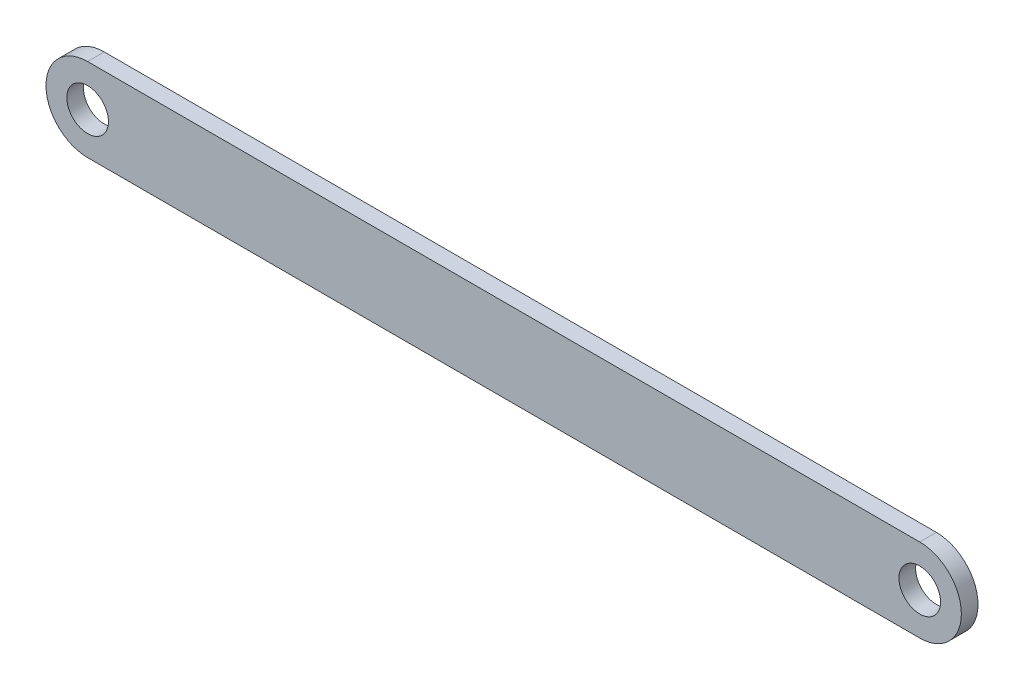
from build123d import *

# Parameters (mm, degrees)
SKETCH1_R           = 2.5
BOSS_EXTRUDE1_DEPTH = 1


with BuildPart() as part:
    # Sketch1 → Boss-Extrude1 (new, symmetric)
    with BuildSketch(Plane.XY):
        with BuildLine():
            Line((-50, 5), (50, 5))
            ThreePointArc((50, 5), (55, 0), (50, -5))
            Line((50, -5), (-50, -5))
            ThreePointArc((-50, -5), (-55, 0), (-50, 5))
        make_face()
        with Locations((-50, 0)):
            Circle(SKETCH1_R, mode=Mode.SUBTRACT)
        with Locations((50, 0)):
            Circle(SKETCH1_R, mode=Mode.SUBTRACT)
    extrude(amount=BOSS_EXTRUDE1_DEPTH, both=True)


solid = part.part
